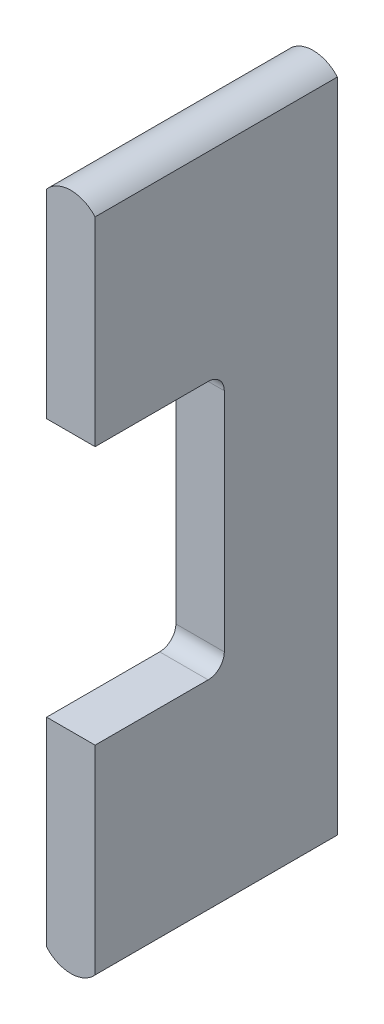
ISO-10303-21;
HEADER;
FILE_DESCRIPTION(('STEP AP214'),'2;1');
FILE_NAME('part.step','',(''),(''),'','','');
FILE_SCHEMA(('AUTOMOTIVE_DESIGN { 1 0 10303 214 1 1 1 1 }'));
ENDSEC;
DATA;
#1=APPLICATION_CONTEXT('core data for automotive mechanical design processes');
#2=APPLICATION_PROTOCOL_DEFINITION('international standard','automotive_design',2000,#1);
#3=PRODUCT_CONTEXT('',#1,'mechanical');
#4=PRODUCT('Part','Part','',(#3));
#5=PRODUCT_RELATED_PRODUCT_CATEGORY('part','',(#4));
#6=PRODUCT_DEFINITION_FORMATION('','',#4);
#7=PRODUCT_DEFINITION_CONTEXT('part definition',#1,'design');
#8=PRODUCT_DEFINITION('design','',#6,#7);
#9=PRODUCT_DEFINITION_SHAPE('','',#8);
#10=(LENGTH_UNIT() NAMED_UNIT(*) SI_UNIT(.MILLI.,.METRE.));
#11=(NAMED_UNIT(*) PLANE_ANGLE_UNIT() SI_UNIT($,.RADIAN.));
#12=(NAMED_UNIT(*) SI_UNIT($,.STERADIAN.) SOLID_ANGLE_UNIT());
#13=UNCERTAINTY_MEASURE_WITH_UNIT(LENGTH_MEASURE(1.E-05),#10,'distance_accuracy_value','');
#14=(GEOMETRIC_REPRESENTATION_CONTEXT(3) GLOBAL_UNCERTAINTY_ASSIGNED_CONTEXT((#13)) GLOBAL_UNIT_ASSIGNED_CONTEXT((#10,
#11,#12)) REPRESENTATION_CONTEXT('',''));
#15=CARTESIAN_POINT('',(0.,0.,0.));
#16=DIRECTION('',(0.,0.,1.));
#17=DIRECTION('',(1.,0.,0.));
#18=AXIS2_PLACEMENT_3D('',#15,#16,#17);
#19=CARTESIAN_POINT('',(0.,-18.9999999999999,15.0000000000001));
#20=DIRECTION('',(0.,0.,0.999999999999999));
#21=DIRECTION('',(1.00000000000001,0.,0.));
#22=AXIS2_PLACEMENT_3D('',#19,#20,#21);
#23=PLANE('',#22);
#24=DIRECTION('',(1.00000000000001,0.,0.));
#25=VECTOR('',#24,1.);
#26=CARTESIAN_POINT('',(-1.5,-7.99999999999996,15.));
#27=LINE('',#26,#25);
#28=CARTESIAN_POINT('',(-1.5,-7.99999999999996,15.));
#29=VERTEX_POINT('',#28);
#30=CARTESIAN_POINT('',(1.50000000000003,-7.99999999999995,15.));
#31=VERTEX_POINT('',#30);
#32=EDGE_CURVE('E126',#29,#31,#27,.T.);
#33=ORIENTED_EDGE('',*,*,#32,.F.);
#34=DIRECTION('',(0.,-0.999999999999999,0.));
#35=VECTOR('',#34,1.);
#36=CARTESIAN_POINT('',(-1.5,20.3228756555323,15.0000000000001));
#37=LINE('',#36,#35);
#38=CARTESIAN_POINT('',(-1.50000000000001,-20.3228756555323,15.));
#39=VERTEX_POINT('',#38);
#40=EDGE_CURVE('E54',#29,#39,#37,.T.);
#41=ORIENTED_EDGE('',*,*,#40,.T.);
#42=CARTESIAN_POINT('',(0.,-18.9999999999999,15.0000000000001));
#43=DIRECTION('',(0.,0.,0.999999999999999));
#44=DIRECTION('',(1.00000000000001,0.,0.));
#45=AXIS2_PLACEMENT_3D('',#42,#43,#44);
#46=CIRCLE('',#45,2.);
#47=CARTESIAN_POINT('',(1.50000000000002,-20.3228756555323,15.));
#48=VERTEX_POINT('',#47);
#49=EDGE_CURVE('E169',#39,#48,#46,.T.);
#50=ORIENTED_EDGE('',*,*,#49,.T.);
#51=DIRECTION('',(0.,0.999999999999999,0.));
#52=VECTOR('',#51,1.);
#53=CARTESIAN_POINT('',(1.50000000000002,20.3228756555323,15.));
#54=LINE('',#53,#52);
#55=EDGE_CURVE('E172',#48,#31,#54,.T.);
#56=ORIENTED_EDGE('',*,*,#55,.T.);
#57=EDGE_LOOP('',(#33,#41,#50,#56));
#58=FACE_BOUND('',#57,.T.);
#59=ADVANCED_FACE('F31',(#58),#23,.T.);
#60=CARTESIAN_POINT('',(0.,-18.9999999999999,15.0000000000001));
#61=DIRECTION('',(0.,0.,-0.999999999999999));
#62=DIRECTION('',(-1.00000000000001,0.,0.));
#63=AXIS2_PLACEMENT_3D('',#60,#61,#62);
#64=CYLINDRICAL_SURFACE('',#63,2.);
#65=CARTESIAN_POINT('',(0.,-19.,0.));
#66=DIRECTION('',(0.,0.,0.999999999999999));
#67=DIRECTION('',(1.00000000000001,0.,0.));
#68=AXIS2_PLACEMENT_3D('',#65,#66,#67);
#69=CIRCLE('',#68,2.);
#70=CARTESIAN_POINT('',(-1.5,-20.3228756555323,0.));
#71=VERTEX_POINT('',#70);
#72=CARTESIAN_POINT('',(1.50000000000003,-20.3228756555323,0.));
#73=VERTEX_POINT('',#72);
#74=EDGE_CURVE('E153',#71,#73,#69,.T.);
#75=ORIENTED_EDGE('',*,*,#74,.T.);
#76=DIRECTION('',(0.,0.,-0.999999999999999));
#77=VECTOR('',#76,1.);
#78=CARTESIAN_POINT('',(1.50000000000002,-20.3228756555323,15.));
#79=LINE('',#78,#77);
#80=EDGE_CURVE('E11',#48,#73,#79,.T.);
#81=ORIENTED_EDGE('',*,*,#80,.F.);
#82=ORIENTED_EDGE('',*,*,#49,.F.);
#83=DIRECTION('',(0.,0.,-0.999999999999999));
#84=VECTOR('',#83,1.);
#85=CARTESIAN_POINT('',(-1.50000000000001,-20.3228756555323,15.));
#86=LINE('',#85,#84);
#87=EDGE_CURVE('E179',#39,#71,#86,.T.);
#88=ORIENTED_EDGE('',*,*,#87,.T.);
#89=EDGE_LOOP('',(#75,#81,#82,#88));
#90=FACE_BOUND('',#89,.T.);
#91=ADVANCED_FACE('F33',(#90),#64,.T.);
#92=CARTESIAN_POINT('',(1.50000000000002,20.3228756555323,15.));
#93=DIRECTION('',(-1.00000000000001,0.,0.));
#94=DIRECTION('',(0.,-0.999999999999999,0.));
#95=AXIS2_PLACEMENT_3D('',#92,#93,#94);
#96=PLANE('',#95);
#97=CARTESIAN_POINT('',(1.50000000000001,-6.99999999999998,8.));
#98=DIRECTION('',(1.00000000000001,0.,0.));
#99=DIRECTION('',(0.,-0.999999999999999,0.));
#100=AXIS2_PLACEMENT_3D('',#97,#98,#99);
#101=CIRCLE('',#100,1.);
#102=CARTESIAN_POINT('',(1.50000000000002,-7.99999999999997,7.99999999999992));
#103=VERTEX_POINT('',#102);
#104=CARTESIAN_POINT('',(1.50000000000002,-6.99999999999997,7.00000000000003));
#105=VERTEX_POINT('',#104);
#106=EDGE_CURVE('E114',#103,#105,#101,.T.);
#107=ORIENTED_EDGE('',*,*,#106,.F.);
#108=DIRECTION('',(0.,0.,-0.999999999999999));
#109=VECTOR('',#108,1.);
#110=CARTESIAN_POINT('',(1.50000000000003,-7.99999999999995,15.));
#111=LINE('',#110,#109);
#112=EDGE_CURVE('E124',#31,#103,#111,.T.);
#113=ORIENTED_EDGE('',*,*,#112,.F.);
#114=ORIENTED_EDGE('',*,*,#55,.F.);
#115=ORIENTED_EDGE('',*,*,#80,.T.);
#116=DIRECTION('',(0.,0.999999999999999,0.));
#117=VECTOR('',#116,1.);
#118=CARTESIAN_POINT('',(1.50000000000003,20.3228756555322,0.));
#119=LINE('',#118,#117);
#120=CARTESIAN_POINT('',(1.50000000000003,20.3228756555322,0.));
#121=VERTEX_POINT('',#120);
#122=EDGE_CURVE('E163',#73,#121,#119,.T.);
#123=ORIENTED_EDGE('',*,*,#122,.T.);
#124=DIRECTION('',(0.,0.,-0.999999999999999));
#125=VECTOR('',#124,1.);
#126=CARTESIAN_POINT('',(1.50000000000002,20.3228756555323,15.));
#127=LINE('',#126,#125);
#128=CARTESIAN_POINT('',(1.50000000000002,20.3228756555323,15.));
#129=VERTEX_POINT('',#128);
#130=EDGE_CURVE('E39',#129,#121,#127,.T.);
#131=ORIENTED_EDGE('',*,*,#130,.F.);
#132=CARTESIAN_POINT('',(1.50000000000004,8.00000000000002,15.));
#133=VERTEX_POINT('',#132);
#134=EDGE_CURVE('E171',#133,#129,#54,.T.);
#135=ORIENTED_EDGE('',*,*,#134,.F.);
#136=DIRECTION('',(0.,0.,0.999999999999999));
#137=VECTOR('',#136,1.);
#138=CARTESIAN_POINT('',(1.50000000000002,8.,8.00000000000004));
#139=LINE('',#138,#137);
#140=CARTESIAN_POINT('',(1.50000000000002,8.,8.00000000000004));
#141=VERTEX_POINT('',#140);
#142=EDGE_CURVE('E46',#141,#133,#139,.T.);
#143=ORIENTED_EDGE('',*,*,#142,.F.);
#144=CARTESIAN_POINT('',(1.50000000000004,6.99999999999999,8.00000000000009));
#145=DIRECTION('',(1.00000000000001,0.,0.));
#146=DIRECTION('',(0.,-0.999999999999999,0.));
#147=AXIS2_PLACEMENT_3D('',#144,#145,#146);
#148=CIRCLE('',#147,1.);
#149=CARTESIAN_POINT('',(1.50000000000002,6.99999999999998,7.00000000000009));
#150=VERTEX_POINT('',#149);
#151=EDGE_CURVE('E135',#150,#141,#148,.T.);
#152=ORIENTED_EDGE('',*,*,#151,.F.);
#153=DIRECTION('',(0.,0.999999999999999,0.));
#154=VECTOR('',#153,1.);
#155=CARTESIAN_POINT('',(1.50000000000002,-6.99999999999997,7.00000000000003));
#156=LINE('',#155,#154);
#157=EDGE_CURVE('E133',#105,#150,#156,.T.);
#158=ORIENTED_EDGE('',*,*,#157,.F.);
#159=EDGE_LOOP('',(#107,#113,#114,#115,#123,#131,#135,#143,#152,#158));
#160=FACE_BOUND('',#159,.T.);
#161=ADVANCED_FACE('F130',(#160),#96,.F.);
#162=CARTESIAN_POINT('',(0.,19.,15.));
#163=DIRECTION('',(0.,0.,-0.999999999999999));
#164=DIRECTION('',(-1.00000000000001,0.,0.));
#165=AXIS2_PLACEMENT_3D('',#162,#163,#164);
#166=CYLINDRICAL_SURFACE('',#165,2.);
#167=CARTESIAN_POINT('',(0.,19.,0.));
#168=DIRECTION('',(0.,0.,0.999999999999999));
#169=DIRECTION('',(1.00000000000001,0.,0.));
#170=AXIS2_PLACEMENT_3D('',#167,#168,#169);
#171=CIRCLE('',#170,2.);
#172=CARTESIAN_POINT('',(-1.5,20.3228756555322,0.));
#173=VERTEX_POINT('',#172);
#174=EDGE_CURVE('E165',#121,#173,#171,.T.);
#175=ORIENTED_EDGE('',*,*,#174,.T.);
#176=DIRECTION('',(0.,0.,-0.999999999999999));
#177=VECTOR('',#176,1.);
#178=CARTESIAN_POINT('',(-1.5,20.3228756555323,15.0000000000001));
#179=LINE('',#178,#177);
#180=CARTESIAN_POINT('',(-1.5,20.3228756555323,15.0000000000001));
#181=VERTEX_POINT('',#180);
#182=EDGE_CURVE('E182',#181,#173,#179,.T.);
#183=ORIENTED_EDGE('',*,*,#182,.F.);
#184=CARTESIAN_POINT('',(0.,19.,15.));
#185=DIRECTION('',(0.,0.,0.999999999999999));
#186=DIRECTION('',(1.00000000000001,0.,0.));
#187=AXIS2_PLACEMENT_3D('',#184,#185,#186);
#188=CIRCLE('',#187,2.);
#189=EDGE_CURVE('E174',#129,#181,#188,.T.);
#190=ORIENTED_EDGE('',*,*,#189,.F.);
#191=ORIENTED_EDGE('',*,*,#130,.T.);
#192=EDGE_LOOP('',(#175,#183,#190,#191));
#193=FACE_BOUND('',#192,.T.);
#194=ADVANCED_FACE('F189',(#193),#166,.T.);
#195=CARTESIAN_POINT('',(-1.5,20.3228756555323,15.0000000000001));
#196=DIRECTION('',(1.00000000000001,0.,0.));
#197=DIRECTION('',(0.,0.999999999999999,0.));
#198=AXIS2_PLACEMENT_3D('',#195,#196,#197);
#199=PLANE('',#198);
#200=ORIENTED_EDGE('',*,*,#40,.F.);
#201=DIRECTION('',(0.,0.,-0.999999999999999));
#202=VECTOR('',#201,1.);
#203=CARTESIAN_POINT('',(-1.5,-7.99999999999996,15.));
#204=LINE('',#203,#202);
#205=CARTESIAN_POINT('',(-1.50000000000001,-7.99999999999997,8.00000000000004));
#206=VERTEX_POINT('',#205);
#207=EDGE_CURVE('E141',#29,#206,#204,.T.);
#208=ORIENTED_EDGE('',*,*,#207,.T.);
#209=CARTESIAN_POINT('',(-1.50000000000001,-6.99999999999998,7.99999999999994));
#210=DIRECTION('',(1.00000000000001,0.,0.));
#211=DIRECTION('',(0.,-0.999999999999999,0.));
#212=AXIS2_PLACEMENT_3D('',#209,#210,#211);
#213=CIRCLE('',#212,1.);
#214=CARTESIAN_POINT('',(-1.50000000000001,-6.99999999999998,6.99999999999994));
#215=VERTEX_POINT('',#214);
#216=EDGE_CURVE('E117',#206,#215,#213,.T.);
#217=ORIENTED_EDGE('',*,*,#216,.T.);
#218=DIRECTION('',(0.,0.999999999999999,0.));
#219=VECTOR('',#218,1.);
#220=CARTESIAN_POINT('',(-1.50000000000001,-6.99999999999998,6.99999999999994));
#221=LINE('',#220,#219);
#222=CARTESIAN_POINT('',(-1.5,6.99999999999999,7.00000000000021));
#223=VERTEX_POINT('',#222);
#224=EDGE_CURVE('E144',#215,#223,#221,.T.);
#225=ORIENTED_EDGE('',*,*,#224,.T.);
#226=CARTESIAN_POINT('',(-1.50000000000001,7.,8.0000000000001));
#227=DIRECTION('',(1.00000000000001,0.,0.));
#228=DIRECTION('',(0.,-0.999999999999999,0.));
#229=AXIS2_PLACEMENT_3D('',#226,#227,#228);
#230=CIRCLE('',#229,1.);
#231=CARTESIAN_POINT('',(-1.50000000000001,8.,8.00000000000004));
#232=VERTEX_POINT('',#231);
#233=EDGE_CURVE('E147',#223,#232,#230,.T.);
#234=ORIENTED_EDGE('',*,*,#233,.T.);
#235=DIRECTION('',(0.,0.,0.999999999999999));
#236=VECTOR('',#235,1.);
#237=CARTESIAN_POINT('',(-1.50000000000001,8.,8.00000000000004));
#238=LINE('',#237,#236);
#239=CARTESIAN_POINT('',(-1.5,8.00000000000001,15.));
#240=VERTEX_POINT('',#239);
#241=EDGE_CURVE('E121',#232,#240,#238,.T.);
#242=ORIENTED_EDGE('',*,*,#241,.T.);
#243=EDGE_CURVE('E176',#181,#240,#37,.T.);
#244=ORIENTED_EDGE('',*,*,#243,.F.);
#245=ORIENTED_EDGE('',*,*,#182,.T.);
#246=DIRECTION('',(0.,-0.999999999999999,0.));
#247=VECTOR('',#246,1.);
#248=CARTESIAN_POINT('',(-1.5,20.3228756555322,0.));
#249=LINE('',#248,#247);
#250=EDGE_CURVE('E167',#173,#71,#249,.T.);
#251=ORIENTED_EDGE('',*,*,#250,.T.);
#252=ORIENTED_EDGE('',*,*,#87,.F.);
#253=EDGE_LOOP('',(#200,#208,#217,#225,#234,#242,#244,#245,#251,#252));
#254=FACE_BOUND('',#253,.T.);
#255=ADVANCED_FACE('F197',(#254),#199,.F.);
#256=DIRECTION('',(1.00000000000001,0.,0.));
#257=VECTOR('',#256,1.);
#258=CARTESIAN_POINT('',(-1.5,8.00000000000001,15.));
#259=LINE('',#258,#257);
#260=EDGE_CURVE('E154',#240,#133,#259,.T.);
#261=ORIENTED_EDGE('',*,*,#260,.T.);
#262=ORIENTED_EDGE('',*,*,#134,.T.);
#263=ORIENTED_EDGE('',*,*,#189,.T.);
#264=ORIENTED_EDGE('',*,*,#243,.T.);
#265=EDGE_LOOP('',(#261,#262,#263,#264));
#266=FACE_BOUND('',#265,.T.);
#267=ADVANCED_FACE('F211',(#266),#23,.T.);
#268=CARTESIAN_POINT('',(0.,-19.,0.));
#269=DIRECTION('',(0.,0.,0.999999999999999));
#270=DIRECTION('',(1.00000000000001,0.,0.));
#271=AXIS2_PLACEMENT_3D('',#268,#269,#270);
#272=PLANE('',#271);
#273=ORIENTED_EDGE('',*,*,#74,.F.);
#274=ORIENTED_EDGE('',*,*,#250,.F.);
#275=ORIENTED_EDGE('',*,*,#174,.F.);
#276=ORIENTED_EDGE('',*,*,#122,.F.);
#277=EDGE_LOOP('',(#273,#274,#275,#276));
#278=FACE_BOUND('',#277,.T.);
#279=ADVANCED_FACE('F195',(#278),#272,.F.);
#280=CARTESIAN_POINT('',(-1.5,-7.99999999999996,15.));
#281=DIRECTION('',(0.,-0.999999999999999,0.));
#282=DIRECTION('',(0.,0.,-0.999999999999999));
#283=AXIS2_PLACEMENT_3D('',#280,#281,#282);
#284=PLANE('',#283);
#285=ORIENTED_EDGE('',*,*,#112,.T.);
#286=DIRECTION('',(1.00000000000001,0.,0.));
#287=VECTOR('',#286,1.);
#288=CARTESIAN_POINT('',(-1.50000000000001,-7.99999999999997,8.00000000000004));
#289=LINE('',#288,#287);
#290=EDGE_CURVE('E110',#206,#103,#289,.T.);
#291=ORIENTED_EDGE('',*,*,#290,.F.);
#292=ORIENTED_EDGE('',*,*,#207,.F.);
#293=ORIENTED_EDGE('',*,*,#32,.T.);
#294=EDGE_LOOP('',(#285,#291,#292,#293));
#295=FACE_BOUND('',#294,.T.);
#296=ADVANCED_FACE('F125',(#295),#284,.F.);
#297=CARTESIAN_POINT('',(-1.50000000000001,8.,8.00000000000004));
#298=DIRECTION('',(0.,0.999999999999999,0.));
#299=DIRECTION('',(0.,0.,0.999999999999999));
#300=AXIS2_PLACEMENT_3D('',#297,#298,#299);
#301=PLANE('',#300);
#302=ORIENTED_EDGE('',*,*,#142,.T.);
#303=ORIENTED_EDGE('',*,*,#260,.F.);
#304=ORIENTED_EDGE('',*,*,#241,.F.);
#305=DIRECTION('',(1.00000000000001,0.,0.));
#306=VECTOR('',#305,1.);
#307=CARTESIAN_POINT('',(-1.50000000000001,8.,8.00000000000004));
#308=LINE('',#307,#306);
#309=EDGE_CURVE('E156',#232,#141,#308,.T.);
#310=ORIENTED_EDGE('',*,*,#309,.T.);
#311=EDGE_LOOP('',(#302,#303,#304,#310));
#312=FACE_BOUND('',#311,.T.);
#313=ADVANCED_FACE('F209',(#312),#301,.F.);
#314=CARTESIAN_POINT('',(-1.50000000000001,7.,8.0000000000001));
#315=DIRECTION('',(1.00000000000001,0.,0.));
#316=DIRECTION('',(0.,0.999999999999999,0.));
#317=AXIS2_PLACEMENT_3D('',#314,#315,#316);
#318=CYLINDRICAL_SURFACE('',#317,1.);
#319=ORIENTED_EDGE('',*,*,#151,.T.);
#320=ORIENTED_EDGE('',*,*,#309,.F.);
#321=ORIENTED_EDGE('',*,*,#233,.F.);
#322=DIRECTION('',(1.00000000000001,0.,0.));
#323=VECTOR('',#322,1.);
#324=CARTESIAN_POINT('',(-1.5,6.99999999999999,7.00000000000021));
#325=LINE('',#324,#323);
#326=EDGE_CURVE('E158',#223,#150,#325,.T.);
#327=ORIENTED_EDGE('',*,*,#326,.T.);
#328=EDGE_LOOP('',(#319,#320,#321,#327));
#329=FACE_BOUND('',#328,.T.);
#330=ADVANCED_FACE('F207',(#329),#318,.F.);
#331=CARTESIAN_POINT('',(-1.50000000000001,-6.99999999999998,6.99999999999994));
#332=DIRECTION('',(0.,0.,-0.999999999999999));
#333=DIRECTION('',(-1.00000000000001,0.,0.));
#334=AXIS2_PLACEMENT_3D('',#331,#332,#333);
#335=PLANE('',#334);
#336=ORIENTED_EDGE('',*,*,#157,.T.);
#337=ORIENTED_EDGE('',*,*,#326,.F.);
#338=ORIENTED_EDGE('',*,*,#224,.F.);
#339=DIRECTION('',(1.00000000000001,0.,0.));
#340=VECTOR('',#339,1.);
#341=CARTESIAN_POINT('',(-1.50000000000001,-6.99999999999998,6.99999999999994));
#342=LINE('',#341,#340);
#343=EDGE_CURVE('E120',#215,#105,#342,.T.);
#344=ORIENTED_EDGE('',*,*,#343,.T.);
#345=EDGE_LOOP('',(#336,#337,#338,#344));
#346=FACE_BOUND('',#345,.T.);
#347=ADVANCED_FACE('F205',(#346),#335,.F.);
#348=CARTESIAN_POINT('',(-1.50000000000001,-6.99999999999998,7.99999999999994));
#349=DIRECTION('',(1.00000000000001,0.,0.));
#350=DIRECTION('',(0.,0.999999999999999,0.));
#351=AXIS2_PLACEMENT_3D('',#348,#349,#350);
#352=CYLINDRICAL_SURFACE('',#351,1.);
#353=ORIENTED_EDGE('',*,*,#106,.T.);
#354=ORIENTED_EDGE('',*,*,#343,.F.);
#355=ORIENTED_EDGE('',*,*,#216,.F.);
#356=ORIENTED_EDGE('',*,*,#290,.T.);
#357=EDGE_LOOP('',(#353,#354,#355,#356));
#358=FACE_BOUND('',#357,.T.);
#359=ADVANCED_FACE('F112',(#358),#352,.F.);
#360=CLOSED_SHELL('',(#59,#91,#161,#194,#255,#267,#279,#296,#313,#330,#347,#359));
#361=MANIFOLD_SOLID_BREP('B2',#360);
#362=ADVANCED_BREP_SHAPE_REPRESENTATION('',(#18,#361),#14);
#363=SHAPE_DEFINITION_REPRESENTATION(#9,#362);
ENDSEC;
END-ISO-10303-21;
